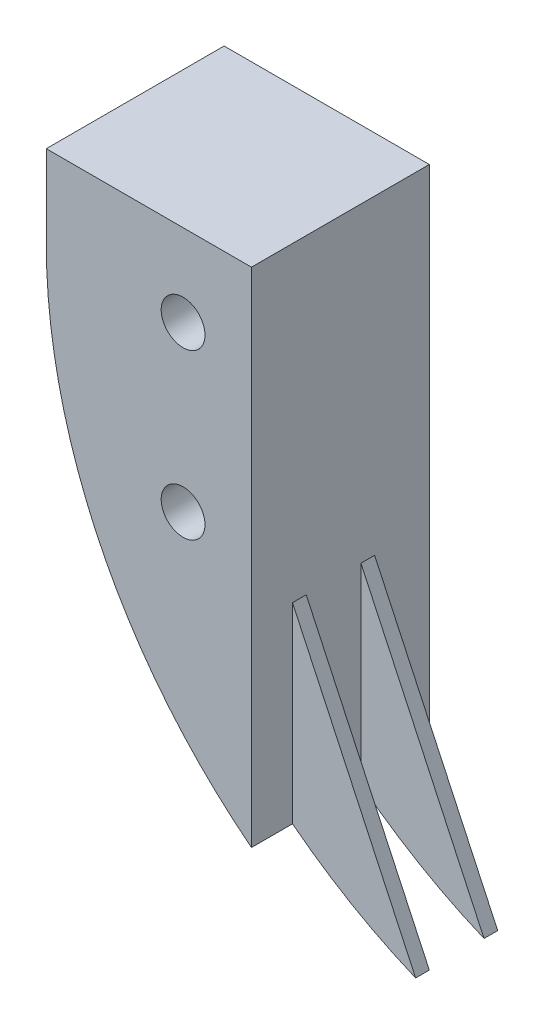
from build123d import *

# Parameters (mm, degrees)
BOSS_EXTRU_1_DEPTH         = 6.5
BOSS_EXTRU_2_START         = -0.5
BOSS_EXTRU_2_DEPTH         = 0.5
R_P_TITION_LIN_AIRE1_COUNT = 2
R_P_TITION_LIN_AIRE1_PITCH = 2.5
TROU_TARAUD_M21_D          = 1.6
TROU_TARAUD_M21_DEPTH      = 4
TROU_TARAUD_M21_TIP        = 0.480688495


with BuildPart() as part:
    # Esquisse1 → Boss.-Extru.1 (new body)
    with BuildSketch(Plane.XY):
        with BuildLine():
            Line((15.5, 71), (15.5, 68))
            ThreePointArc((15.5, 68), (17.475017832, 59.448684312), (23, 52.629573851))
            Line((23, 52.629573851), (23, 71))
            Line((23, 71), (15.5, 71))
        make_face()
    extrude(amount=BOSS_EXTRU_1_DEPTH)

    # Esquisse2 → Boss.-Extru.2 (add)
    with BuildSketch(Plane.XY.offset(5).offset(BOSS_EXTRU_2_START)):
        with BuildLine():
            Line((23, 59.629573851), (23, 52.629573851))
            ThreePointArc((23, 52.629573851), (25.161749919, 51.163764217), (27.5, 50))
            Line((27.5, 50), (23, 59.629573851))
        make_face()
    boss_extru_2 = extrude(amount=BOSS_EXTRU_2_DEPTH)

    # R_p_tition lin_aire1: Boss.-Extru.2 ×2
    with Locations(*[(0, 0, -i * R_P_TITION_LIN_AIRE1_PITCH) for i in range(1, R_P_TITION_LIN_AIRE1_COUNT)]):
        add(boss_extru_2)

    # Trou taraud_ M21
    with Locations(Plane.XY.offset(6.5)):
        with Locations((20.5, 68), (20.5, 62)):
            Hole(TROU_TARAUD_M21_D / 2, depth=TROU_TARAUD_M21_DEPTH)
            with Locations((0, 0, -(TROU_TARAUD_M21_DEPTH + TROU_TARAUD_M21_TIP / 2))):  # 118° drill point
                Cone(0, TROU_TARAUD_M21_D / 2, TROU_TARAUD_M21_TIP, mode=Mode.SUBTRACT)


solid = part.part
